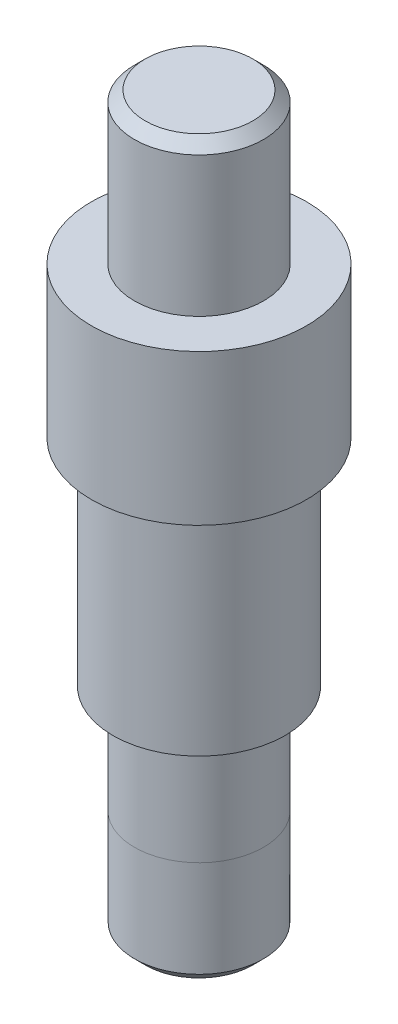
from build123d import *

# Parameters (mm, degrees)
SKETCH1_R      = 5
EXTRUDE1_DEPTH = 7
SKETCH2_R      = 3
EXTRUDE2_DEPTH = 7
SKETCH3_R      = 4
EXTRUDE3_DEPTH = 10
EXTRUDE4_START = 5
SKETCH4_R      = 3
EXTRUDE4_DEPTH = 5
SKETCH5_R      = 2.99
EXTRUDE5_DEPTH = 5
CHAMFER1_SIZE  = 0.5


with BuildPart() as part:
    # Sketch1 → Extrude1 (new body)
    with BuildSketch(Plane(origin=(0, 0, 0), x_dir=(1, 0, 0), z_dir=(0, 1, 0))):
        with Locations(Location((0, 0, 0), (0, 0, 270))):
            Circle(SKETCH1_R)
    extrude(amount=EXTRUDE1_DEPTH)

    # Sketch2 → Extrude2 (add)
    with BuildSketch(Plane(origin=(0, 7, 0), x_dir=(-1, 0, 0), z_dir=(0, 1, 0))):
        with Locations(Location((0, 0, 0), (0, 0, 90))):
            Circle(SKETCH2_R)
    extrude(amount=EXTRUDE2_DEPTH)

    # Sketch3 → Extrude3 (add)
    with BuildSketch(Plane.XZ):
        with Locations(Location((0, 0, 0), (0, 0, 90))):
            Circle(SKETCH3_R)
    extrude(amount=EXTRUDE3_DEPTH)

    # Sketch4 → Extrude4 (add)
    with BuildSketch(Plane.XZ.offset(10).offset(EXTRUDE4_START)):
        with Locations(Location((0, 0, 0), (0, 0, 90))):
            Circle(SKETCH4_R)
    extrude(amount=-EXTRUDE4_DEPTH)

    # Sketch5 → Extrude5 (add)
    with BuildSketch(Plane.XZ.offset(15)):
        with Locations(Location((0, 0, 0), (0, 0, 270))):
            Circle(SKETCH5_R)
    extrude(amount=EXTRUDE5_DEPTH)

    # Chamfer1
    chamfer1_edges = [part.edges().sort_by_distance(p)[0] for p in [
        (0, -20, 2.99),
        (0, 14, -3),
    ]]
    chamfer(chamfer1_edges, length=CHAMFER1_SIZE)


solid = part.part
